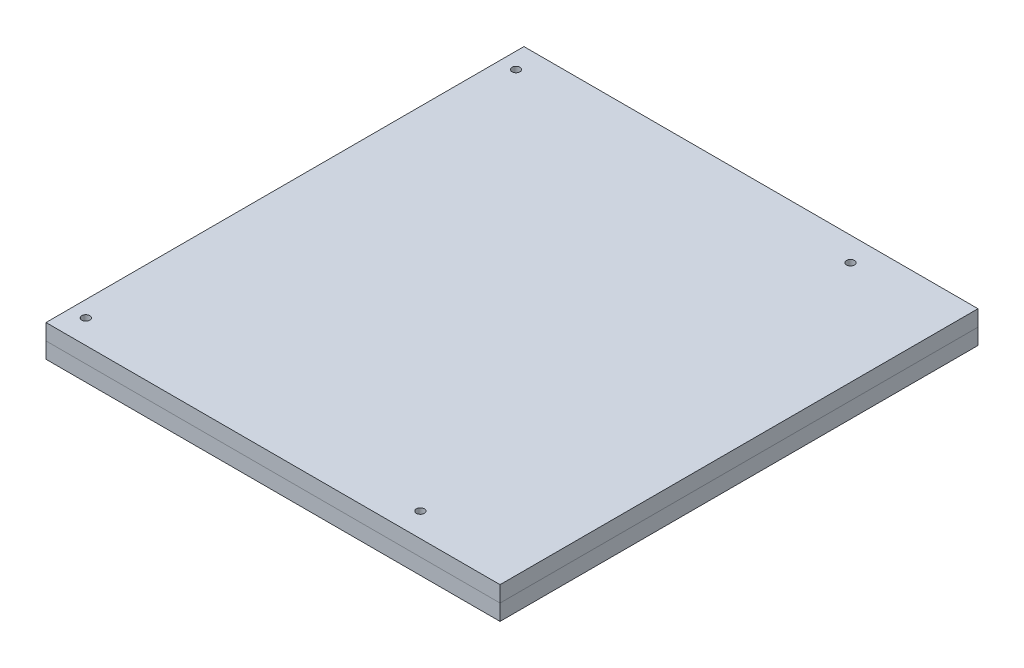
from build123d import *

# Parameters (mm, degrees)
SKETCH1_W           = 171
SKETCH1_H           = 180
BOSS_EXTRUDE1_DEPTH = 6
SKETCH2_W           = 171
SKETCH2_H           = 180
BOSS_EXTRUDE2_DEPTH = 6
SKETCH3_R           = 1.5
CUT_EXTRUDE1_DEPTH  = 249.565886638


with BuildPart() as part:
    # Sketch1 → Boss-Extrude1 (new body)
    with BuildSketch(Plane(origin=(0, 0, 0), x_dir=(1, 0, 0), z_dir=(0, 1, 0))):
        with Locations((85.5, -90)):
            Rectangle(SKETCH1_W, SKETCH1_H)
    extrude(amount=BOSS_EXTRUDE1_DEPTH)


with BuildPart() as body_2:
    # Sketch2 → Boss-Extrude2 (new body)
    with BuildSketch(Plane(origin=(0, 6, 0), x_dir=(1, 0, 0), z_dir=(0, 1, 0))):
        with Locations((85.5, -90)):
            Rectangle(SKETCH2_W, SKETCH2_H)
    extrude(amount=BOSS_EXTRUDE2_DEPTH)


with BuildPart() as cut_extrude1_tool:
    # Sketch3 → Cut-Extrude1 (new, through all)
    with BuildSketch(Plane(origin=(0, 12, 0), x_dir=(1, 0, 0), z_dir=(0, 1, 0))):
        with Locations(Location((6, -9, 0), (0, 0, 270))):
            Circle(SKETCH3_R)
        with Locations(Location((132, -9, 0), (0, 0, 270))):
            Circle(SKETCH3_R)
        with Locations(Location((132, -171, 0), (0, 0, 270))):
            Circle(SKETCH3_R)
        with Locations(Location((6, -171, 0), (0, 0, 270))):
            Circle(SKETCH3_R)
    extrude(amount=-CUT_EXTRUDE1_DEPTH)


with BuildPart() as part_1:
    add(part.part)

    # Cut-Extrude1: cut by cut_extrude1_tool
    add(cut_extrude1_tool.part, mode=Mode.SUBTRACT)


with BuildPart() as body_2_1:
    add(body_2.part)

    # Cut-Extrude1: cut by cut_extrude1_tool
    add(cut_extrude1_tool.part, mode=Mode.SUBTRACT)


solid = Compound([part_1.part, body_2_1.part])
